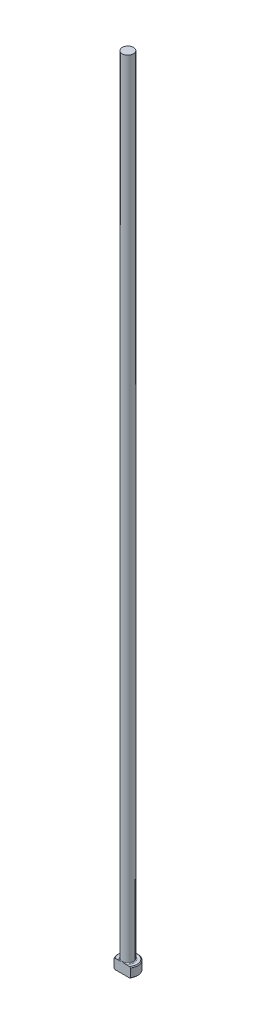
ISO-10303-21;
HEADER;
FILE_DESCRIPTION(('STEP AP214'),'2;1');
FILE_NAME('part.step','',(''),(''),'','','');
FILE_SCHEMA(('AUTOMOTIVE_DESIGN { 1 0 10303 214 1 1 1 1 }'));
ENDSEC;
DATA;
#1=APPLICATION_CONTEXT('core data for automotive mechanical design processes');
#2=APPLICATION_PROTOCOL_DEFINITION('international standard','automotive_design',2000,#1);
#3=PRODUCT_CONTEXT('',#1,'mechanical');
#4=PRODUCT('Part','Part','',(#3));
#5=PRODUCT_RELATED_PRODUCT_CATEGORY('part','',(#4));
#6=PRODUCT_DEFINITION_FORMATION('','',#4);
#7=PRODUCT_DEFINITION_CONTEXT('part definition',#1,'design');
#8=PRODUCT_DEFINITION('design','',#6,#7);
#9=PRODUCT_DEFINITION_SHAPE('','',#8);
#10=(LENGTH_UNIT() NAMED_UNIT(*) SI_UNIT(.MILLI.,.METRE.));
#11=(NAMED_UNIT(*) PLANE_ANGLE_UNIT() SI_UNIT($,.RADIAN.));
#12=(NAMED_UNIT(*) SI_UNIT($,.STERADIAN.) SOLID_ANGLE_UNIT());
#13=UNCERTAINTY_MEASURE_WITH_UNIT(LENGTH_MEASURE(1.E-05),#10,'distance_accuracy_value','');
#14=(GEOMETRIC_REPRESENTATION_CONTEXT(3) GLOBAL_UNCERTAINTY_ASSIGNED_CONTEXT((#13)) GLOBAL_UNIT_ASSIGNED_CONTEXT((#10,
#11,#12)) REPRESENTATION_CONTEXT('',''));
#15=CARTESIAN_POINT('',(0.,0.,0.));
#16=DIRECTION('',(0.,0.,1.));
#17=DIRECTION('',(1.,0.,0.));
#18=AXIS2_PLACEMENT_3D('',#15,#16,#17);
#19=CARTESIAN_POINT('',(0.,0.,0.));
#20=DIRECTION('',(0.,-1.,0.));
#21=DIRECTION('',(0.,0.,-1.));
#22=AXIS2_PLACEMENT_3D('',#19,#20,#21);
#23=PLANE('',#22);
#24=DIRECTION('',(1.,0.,0.));
#25=VECTOR('',#24,1.);
#26=CARTESIAN_POINT('',(-2.62529735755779,0.,1.78561999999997));
#27=LINE('',#26,#25);
#28=CARTESIAN_POINT('',(-2.31166654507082,0.,1.78561999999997));
#29=VERTEX_POINT('',#28);
#30=CARTESIAN_POINT('',(2.31166654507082,0.,1.78561999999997));
#31=VERTEX_POINT('',#30);
#32=EDGE_CURVE('E92',#29,#31,#27,.T.);
#33=ORIENTED_EDGE('',*,*,#32,.F.);
#34=CARTESIAN_POINT('',(0.,0.,0.));
#35=DIRECTION('',(0.,-1.,0.));
#36=DIRECTION('',(0.,0.,-1.));
#37=AXIS2_PLACEMENT_3D('',#34,#35,#36);
#38=CIRCLE('',#37,2.92099999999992);
#39=EDGE_CURVE('E105',#29,#31,#38,.T.);
#40=ORIENTED_EDGE('',*,*,#39,.T.);
#41=EDGE_LOOP('',(#33,#40));
#42=FACE_BOUND('',#41,.T.);
#43=ADVANCED_FACE('F37',(#42),#23,.T.);
#44=CARTESIAN_POINT('',(0.,259.958771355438,0.));
#45=DIRECTION('',(0.,1.,0.));
#46=DIRECTION('',(0.,0.,1.));
#47=AXIS2_PLACEMENT_3D('',#44,#45,#46);
#48=CYLINDRICAL_SURFACE('',#47,3.17499999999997);
#49=DIRECTION('',(0.,-1.,0.));
#50=VECTOR('',#49,1.);
#51=CARTESIAN_POINT('',(-2.62529735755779,254.,1.78561999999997));
#52=LINE('',#51,#50);
#53=CARTESIAN_POINT('',(-2.62529735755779,2.92100000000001,1.78561999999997));
#54=VERTEX_POINT('',#53);
#55=CARTESIAN_POINT('',(-2.62529735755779,0.254000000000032,1.78561999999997));
#56=VERTEX_POINT('',#55);
#57=EDGE_CURVE('E95',#54,#56,#52,.T.);
#58=ORIENTED_EDGE('',*,*,#57,.F.);
#59=CARTESIAN_POINT('',(0.,2.92100000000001,0.));
#60=DIRECTION('',(0.,1.,0.));
#61=DIRECTION('',(0.,0.,1.));
#62=AXIS2_PLACEMENT_3D('',#59,#60,#61);
#63=CIRCLE('',#62,3.17499999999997);
#64=CARTESIAN_POINT('',(2.62529735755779,2.92100000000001,1.78561999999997));
#65=VERTEX_POINT('',#64);
#66=EDGE_CURVE('E109',#54,#65,#63,.F.);
#67=ORIENTED_EDGE('',*,*,#66,.T.);
#68=DIRECTION('',(0.,-1.,0.));
#69=VECTOR('',#68,1.);
#70=CARTESIAN_POINT('',(2.62529735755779,254.,1.78561999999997));
#71=LINE('',#70,#69);
#72=CARTESIAN_POINT('',(2.62529735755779,0.254000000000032,1.78561999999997));
#73=VERTEX_POINT('',#72);
#74=EDGE_CURVE('E187',#65,#73,#71,.T.);
#75=ORIENTED_EDGE('',*,*,#74,.T.);
#76=CARTESIAN_POINT('',(0.,0.254000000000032,0.));
#77=DIRECTION('',(0.,-1.,0.));
#78=DIRECTION('',(0.,0.,-1.));
#79=AXIS2_PLACEMENT_3D('',#76,#77,#78);
#80=CIRCLE('',#79,3.17499999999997);
#81=EDGE_CURVE('E115',#73,#56,#80,.F.);
#82=ORIENTED_EDGE('',*,*,#81,.T.);
#83=EDGE_LOOP('',(#58,#67,#75,#82));
#84=FACE_BOUND('',#83,.T.);
#85=ADVANCED_FACE('F160',(#84),#48,.T.);
#86=CARTESIAN_POINT('',(-3.17499999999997,3.175,0.));
#87=DIRECTION('',(0.,1.,0.));
#88=DIRECTION('',(0.,0.,1.));
#89=AXIS2_PLACEMENT_3D('',#86,#87,#88);
#90=PLANE('',#89);
#91=DIRECTION('',(-1.,0.,0.));
#92=VECTOR('',#91,1.);
#93=CARTESIAN_POINT('',(-3.17499999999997,3.175,1.78561999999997));
#94=LINE('',#93,#92);
#95=CARTESIAN_POINT('',(2.31166654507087,3.175,1.78561999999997));
#96=VERTEX_POINT('',#95);
#97=CARTESIAN_POINT('',(0.98570328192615,3.175,1.78561999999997));
#98=VERTEX_POINT('',#97);
#99=EDGE_CURVE('E58',#96,#98,#94,.T.);
#100=ORIENTED_EDGE('',*,*,#99,.F.);
#101=CARTESIAN_POINT('',(0.,3.175,0.));
#102=DIRECTION('',(0.,1.,0.));
#103=DIRECTION('',(0.,0.,1.));
#104=AXIS2_PLACEMENT_3D('',#101,#102,#103);
#105=CIRCLE('',#104,2.92099999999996);
#106=CARTESIAN_POINT('',(-2.31166654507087,3.175,1.78561999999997));
#107=VERTEX_POINT('',#106);
#108=EDGE_CURVE('E182',#96,#107,#105,.T.);
#109=ORIENTED_EDGE('',*,*,#108,.T.);
#110=CARTESIAN_POINT('',(-0.985703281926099,3.17500000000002,1.78561999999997));
#111=VERTEX_POINT('',#110);
#112=EDGE_CURVE('E140',#111,#107,#94,.T.);
#113=ORIENTED_EDGE('',*,*,#112,.F.);
#114=CARTESIAN_POINT('',(0.,3.175,0.));
#115=DIRECTION('',(0.,1.,0.));
#116=DIRECTION('',(0.,0.,1.));
#117=AXIS2_PLACEMENT_3D('',#114,#115,#116);
#118=CIRCLE('',#117,2.03961999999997);
#119=EDGE_CURVE('E112',#111,#98,#118,.F.);
#120=ORIENTED_EDGE('',*,*,#119,.T.);
#121=EDGE_LOOP('',(#100,#109,#113,#120));
#122=FACE_BOUND('',#121,.T.);
#123=ADVANCED_FACE('F164',(#122),#90,.T.);
#124=CARTESIAN_POINT('',(0.,259.958771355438,0.));
#125=DIRECTION('',(0.,1.,0.));
#126=DIRECTION('',(0.,0.,1.));
#127=AXIS2_PLACEMENT_3D('',#124,#125,#126);
#128=CYLINDRICAL_SURFACE('',#127,1.78561999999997);
#129=CARTESIAN_POINT('',(0.,3.42900000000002,0.));
#130=DIRECTION('',(0.,1.,0.));
#131=DIRECTION('',(0.,0.,1.));
#132=AXIS2_PLACEMENT_3D('',#129,#130,#131);
#133=CIRCLE('',#132,1.78561999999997);
#134=CARTESIAN_POINT('',(0.,3.42900000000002,1.78561999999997));
#135=VERTEX_POINT('',#134);
#136=EDGE_CURVE('E108',#135,#135,#133,.T.);
#137=ORIENTED_EDGE('',*,*,#136,.T.);
#138=EDGE_LOOP('',(#137));
#139=FACE_BOUND('',#138,.T.);
#140=CARTESIAN_POINT('',(0.,254.,0.));
#141=DIRECTION('',(0.,1.,0.));
#142=DIRECTION('',(0.,0.,1.));
#143=AXIS2_PLACEMENT_3D('',#140,#141,#142);
#144=CIRCLE('',#143,1.78561999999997);
#145=CARTESIAN_POINT('',(0.,254.,1.78561999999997));
#146=VERTEX_POINT('',#145);
#147=EDGE_CURVE('E100',#146,#146,#144,.T.);
#148=ORIENTED_EDGE('',*,*,#147,.F.);
#149=EDGE_LOOP('',(#148));
#150=FACE_BOUND('',#149,.T.);
#151=ADVANCED_FACE('F169',(#139,#150),#128,.T.);
#152=CARTESIAN_POINT('',(-1.78561999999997,254.,0.));
#153=DIRECTION('',(0.,1.,0.));
#154=DIRECTION('',(0.,0.,1.));
#155=AXIS2_PLACEMENT_3D('',#152,#153,#154);
#156=PLANE('',#155);
#157=ORIENTED_EDGE('',*,*,#147,.T.);
#158=EDGE_LOOP('',(#157));
#159=FACE_BOUND('',#158,.T.);
#160=ADVANCED_FACE('F127',(#159),#156,.T.);
#161=CARTESIAN_POINT('',(0.,3.17499999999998,0.));
#162=DIRECTION('',(0.,-1.,0.));
#163=DIRECTION('',(0.,0.,-1.));
#164=AXIS2_PLACEMENT_3D('',#161,#162,#163);
#165=CONICAL_SURFACE('',#164,2.92099999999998,0.785398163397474);
#166=CARTESIAN_POINT('',(2.62599735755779,2.92042116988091,1.78561999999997));
#167=CARTESIAN_POINT('',(2.53391060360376,2.99651202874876,1.78561999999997));
#168=CARTESIAN_POINT('',(2.44124348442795,3.07192869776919,1.78561999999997));
#169=CARTESIAN_POINT('',(2.25420229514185,3.22083694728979,1.78561999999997));
#170=CARTESIAN_POINT('',(2.15982636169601,3.29432618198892,1.78561999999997));
#171=CARTESIAN_POINT('',(1.96686191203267,3.44026509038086,1.78561999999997));
#172=CARTESIAN_POINT('',(1.8682264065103,3.51265299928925,1.78561999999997));
#173=CARTESIAN_POINT('',(1.66817210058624,3.65342722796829,1.78561999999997));
#174=CARTESIAN_POINT('',(1.56675461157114,3.72181538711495,1.78561999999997));
#175=CARTESIAN_POINT('',(1.39486746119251,3.83076390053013,1.78561999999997));
#176=CARTESIAN_POINT('',(1.32543843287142,3.87295877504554,1.78561999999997));
#177=CARTESIAN_POINT('',(1.18462233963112,3.95393409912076,1.78561999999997));
#178=CARTESIAN_POINT('',(1.11323582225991,3.99271549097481,1.78561999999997));
#179=CARTESIAN_POINT('',(0.968528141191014,4.06558202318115,1.78561999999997));
#180=CARTESIAN_POINT('',(0.895218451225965,4.09968970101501,1.78561999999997));
#181=CARTESIAN_POINT('',(0.74610739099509,4.16195336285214,1.78561999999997));
#182=CARTESIAN_POINT('',(0.67030759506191,4.19011302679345,1.78561999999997));
#183=CARTESIAN_POINT('',(0.541388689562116,4.23076083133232,1.78561999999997));
#184=CARTESIAN_POINT('',(0.488938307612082,4.24536449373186,1.78561999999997));
#185=CARTESIAN_POINT('',(0.383072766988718,4.2704746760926,1.78561999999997));
#186=CARTESIAN_POINT('',(0.329658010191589,4.28098286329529,1.78561999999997));
#187=CARTESIAN_POINT('',(0.222265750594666,4.29737978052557,1.78561999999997));
#188=CARTESIAN_POINT('',(0.168290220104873,4.30328124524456,1.78561999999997));
#189=CARTESIAN_POINT('',(0.0600235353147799,4.31018800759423,1.78561999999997));
#190=CARTESIAN_POINT('',(0.00573239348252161,4.31119349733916,1.78561999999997));
#191=CARTESIAN_POINT('',(-0.102770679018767,4.30824837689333,1.78561999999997));
#192=CARTESIAN_POINT('',(-0.156982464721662,4.30429251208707,1.78561999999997));
#193=CARTESIAN_POINT('',(-0.264851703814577,4.2916403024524,1.78561999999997));
#194=CARTESIAN_POINT('',(-0.318509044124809,4.28294300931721,1.78561999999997));
#195=CARTESIAN_POINT('',(-0.425116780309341,4.26121729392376,1.78561999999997));
#196=CARTESIAN_POINT('',(-0.478064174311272,4.2481743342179,1.78561999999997));
#197=CARTESIAN_POINT('',(-0.58287202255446,4.21832694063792,1.78561999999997));
#198=CARTESIAN_POINT('',(-0.63473246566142,4.20152246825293,1.78561999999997));
#199=CARTESIAN_POINT('',(-0.806507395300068,4.13992967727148,1.78561999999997));
#200=CARTESIAN_POINT('',(-0.923850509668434,4.08797208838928,1.78561999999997));
#201=CARTESIAN_POINT('',(-1.15292848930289,3.97283365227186,1.78561999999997));
#202=CARTESIAN_POINT('',(-1.26465042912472,3.90962833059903,1.78561999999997));
#203=CARTESIAN_POINT('',(-1.4843973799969,3.7755968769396,1.78561999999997));
#204=CARTESIAN_POINT('',(-1.5923926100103,3.70472252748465,1.78561999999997));
#205=CARTESIAN_POINT('',(-1.80492556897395,3.55822828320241,1.78561999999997));
#206=CARTESIAN_POINT('',(-1.90946629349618,3.48261267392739,1.78561999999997));
#207=CARTESIAN_POINT('',(-2.11772685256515,3.3268192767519,1.78561999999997));
#208=CARTESIAN_POINT('',(-2.22140604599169,3.24658747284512,1.78561999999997));
#209=CARTESIAN_POINT('',(-2.37486531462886,3.12489307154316,1.78561999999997));
#210=CARTESIAN_POINT('',(-2.42538004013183,3.08434941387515,1.78561999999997));
#211=CARTESIAN_POINT('',(-2.52598890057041,3.00275013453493,1.78561999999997));
#212=CARTESIAN_POINT('',(-2.57608306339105,2.9616945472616,1.78561999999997));
#213=CARTESIAN_POINT('',(-2.62599735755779,2.92042116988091,1.78561999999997));
#214=B_SPLINE_CURVE_WITH_KNOTS('',3,(#166,#167,#168,#169,#170,#171,#172,#173,#174,#175,#176,
#177,#178,#179,#180,#181,#182,#183,#184,#185,#186,#187,#188,#189,#190,#191,#192,#193,#194,#195,
#196,#197,#198,#199,#200,#201,#202,#203,#204,#205,#206,#207,#208,#209,#210,#211,#212,#213),
.UNSPECIFIED.,.F.,.F.,(4,2,2,2,2,2,2,2,2,2,2,2,2,2,2,2,2,2,2,2,2,2,2,4),(0.,0.358392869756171,
0.717203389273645,1.08418335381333,1.45099320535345,1.69465880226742,1.93825692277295,
2.18063559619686,2.4228638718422,2.58606298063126,2.74919558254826,2.91187561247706,
3.07454925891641,3.23739534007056,3.40027400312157,3.5637031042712,3.72713387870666,
4.11103411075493,4.49578013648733,4.88310369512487,5.27008206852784,5.66332093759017,
5.85763723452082,6.0519405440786),.UNSPECIFIED.);
#215=EDGE_CURVE('E63',#65,#96,#214,.T.);
#216=ORIENTED_EDGE('',*,*,#215,.F.);
#217=ORIENTED_EDGE('',*,*,#66,.F.);
#218=EDGE_CURVE('E133',#107,#54,#214,.T.);
#219=ORIENTED_EDGE('',*,*,#218,.F.);
#220=ORIENTED_EDGE('',*,*,#108,.F.);
#221=EDGE_LOOP('',(#216,#217,#219,#220));
#222=FACE_BOUND('',#221,.T.);
#223=ADVANCED_FACE('F147',(#222),#165,.T.);
#224=CARTESIAN_POINT('',(0.,0.254000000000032,0.));
#225=DIRECTION('',(0.,1.,0.));
#226=DIRECTION('',(0.,0.,1.));
#227=AXIS2_PLACEMENT_3D('',#224,#225,#226);
#228=CONICAL_SURFACE('',#227,3.17499999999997,0.785398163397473);
#229=CARTESIAN_POINT('',(-2.62599735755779,0.254578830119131,1.78561999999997));
#230=CARTESIAN_POINT('',(-2.53391060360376,0.178487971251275,1.78561999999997));
#231=CARTESIAN_POINT('',(-2.44124348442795,0.103071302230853,1.78561999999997));
#232=CARTESIAN_POINT('',(-2.25420229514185,-0.0458369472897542,1.78561999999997));
#233=CARTESIAN_POINT('',(-2.15982636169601,-0.119326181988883,1.78561999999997));
#234=CARTESIAN_POINT('',(-1.96686191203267,-0.265265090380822,1.78561999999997));
#235=CARTESIAN_POINT('',(-1.8682264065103,-0.337652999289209,1.78561999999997));
#236=CARTESIAN_POINT('',(-1.66817210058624,-0.478427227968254,1.78561999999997));
#237=CARTESIAN_POINT('',(-1.56675461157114,-0.546815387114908,1.78561999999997));
#238=CARTESIAN_POINT('',(-1.39486746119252,-0.655763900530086,1.78561999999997));
#239=CARTESIAN_POINT('',(-1.32543843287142,-0.697958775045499,1.78561999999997));
#240=CARTESIAN_POINT('',(-1.18462233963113,-0.778934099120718,1.78561999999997));
#241=CARTESIAN_POINT('',(-1.11323582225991,-0.817715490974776,1.78561999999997));
#242=CARTESIAN_POINT('',(-0.968528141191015,-0.890582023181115,1.78561999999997));
#243=CARTESIAN_POINT('',(-0.895218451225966,-0.924689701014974,1.78561999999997));
#244=CARTESIAN_POINT('',(-0.746107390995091,-0.986953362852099,1.78561999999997));
#245=CARTESIAN_POINT('',(-0.670307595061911,-1.01511302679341,1.78561999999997));
#246=CARTESIAN_POINT('',(-0.541388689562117,-1.05576083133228,1.78561999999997));
#247=CARTESIAN_POINT('',(-0.488938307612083,-1.07036449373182,1.78561999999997));
#248=CARTESIAN_POINT('',(-0.383072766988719,-1.09547467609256,1.78561999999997));
#249=CARTESIAN_POINT('',(-0.32965801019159,-1.10598286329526,1.78561999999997));
#250=CARTESIAN_POINT('',(-0.222265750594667,-1.12237978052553,1.78561999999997));
#251=CARTESIAN_POINT('',(-0.168290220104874,-1.12828124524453,1.78561999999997));
#252=CARTESIAN_POINT('',(-0.0600235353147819,-1.1351880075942,1.78561999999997));
#253=CARTESIAN_POINT('',(-0.00573239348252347,-1.13619349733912,1.78561999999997));
#254=CARTESIAN_POINT('',(0.102770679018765,-1.13324837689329,1.78561999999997));
#255=CARTESIAN_POINT('',(0.15698246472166,-1.12929251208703,1.78561999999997));
#256=CARTESIAN_POINT('',(0.264851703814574,-1.11664030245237,1.78561999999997));
#257=CARTESIAN_POINT('',(0.318509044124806,-1.10794300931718,1.78561999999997));
#258=CARTESIAN_POINT('',(0.425116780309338,-1.08621729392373,1.78561999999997));
#259=CARTESIAN_POINT('',(0.47806417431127,-1.07317433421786,1.78561999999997));
#260=CARTESIAN_POINT('',(0.582872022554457,-1.04332694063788,1.78561999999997));
#261=CARTESIAN_POINT('',(0.634732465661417,-1.02652246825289,1.78561999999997));
#262=CARTESIAN_POINT('',(0.806507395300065,-0.964929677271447,1.78561999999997));
#263=CARTESIAN_POINT('',(0.92385050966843,-0.912972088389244,1.78561999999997));
#264=CARTESIAN_POINT('',(1.15292848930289,-0.797833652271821,1.78561999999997));
#265=CARTESIAN_POINT('',(1.26465042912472,-0.734628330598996,1.78561999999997));
#266=CARTESIAN_POINT('',(1.48439737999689,-0.60059687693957,1.78561999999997));
#267=CARTESIAN_POINT('',(1.59239261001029,-0.529722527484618,1.78561999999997));
#268=CARTESIAN_POINT('',(1.80492556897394,-0.383228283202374,1.78561999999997));
#269=CARTESIAN_POINT('',(1.90946629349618,-0.307612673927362,1.78561999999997));
#270=CARTESIAN_POINT('',(2.11772685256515,-0.151819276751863,1.78561999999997));
#271=CARTESIAN_POINT('',(2.22140604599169,-0.0715874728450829,1.78561999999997));
#272=CARTESIAN_POINT('',(2.37486531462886,0.0501069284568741,1.78561999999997));
#273=CARTESIAN_POINT('',(2.42538004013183,0.0906505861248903,1.78561999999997));
#274=CARTESIAN_POINT('',(2.52598890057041,0.172249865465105,1.78561999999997));
#275=CARTESIAN_POINT('',(2.57608306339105,0.213305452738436,1.78561999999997));
#276=CARTESIAN_POINT('',(2.62599735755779,0.254578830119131,1.78561999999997));
#277=B_SPLINE_CURVE_WITH_KNOTS('',3,(#229,#230,#231,#232,#233,#234,#235,#236,#237,#238,#239,
#240,#241,#242,#243,#244,#245,#246,#247,#248,#249,#250,#251,#252,#253,#254,#255,#256,#257,#258,
#259,#260,#261,#262,#263,#264,#265,#266,#267,#268,#269,#270,#271,#272,#273,#274,#275,#276),
.UNSPECIFIED.,.F.,.F.,(4,2,2,2,2,2,2,2,2,2,2,2,2,2,2,2,2,2,2,2,2,2,2,4),(0.,0.35839286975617,
0.717203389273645,1.08418335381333,1.45099320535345,1.69465880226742,1.93825692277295,
2.18063559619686,2.4228638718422,2.58606298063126,2.74919558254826,2.91187561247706,
3.07454925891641,3.23739534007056,3.40027400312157,3.56370310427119,3.72713387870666,
4.11103411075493,4.49578013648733,4.88310369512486,5.27008206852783,5.66332093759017,
5.85763723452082,6.05194054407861),.UNSPECIFIED.);
#278=EDGE_CURVE('E89',#56,#29,#277,.T.);
#279=ORIENTED_EDGE('',*,*,#278,.F.);
#280=ORIENTED_EDGE('',*,*,#81,.F.);
#281=EDGE_CURVE('E101',#31,#73,#277,.T.);
#282=ORIENTED_EDGE('',*,*,#281,.F.);
#283=ORIENTED_EDGE('',*,*,#39,.F.);
#284=EDGE_LOOP('',(#279,#280,#282,#283));
#285=FACE_BOUND('',#284,.T.);
#286=ADVANCED_FACE('F107',(#285),#228,.T.);
#287=CARTESIAN_POINT('',(0.,3.42900000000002,0.));
#288=DIRECTION('',(0.,1.,0.));
#289=DIRECTION('',(0.,0.,1.));
#290=AXIS2_PLACEMENT_3D('',#287,#288,#289);
#291=TOROIDAL_SURFACE('',#290,2.03961999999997,0.254);
#292=ORIENTED_EDGE('',*,*,#119,.F.);
#293=CARTESIAN_POINT('',(0.,3.42900000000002,1.78561999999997));
#294=CARTESIAN_POINT('',(-3.18449973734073E-11,3.42900057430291,1.78561999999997));
#295=CARTESIAN_POINT('',(-1.31743576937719E-07,3.42900114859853,1.78561999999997));
#296=CARTESIAN_POINT('',(-5.41978407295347E-07,3.42900224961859,1.78561999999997));
#297=CARTESIAN_POINT('',(-8.25231133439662E-07,3.42900277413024,1.78561999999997));
#298=CARTESIAN_POINT('',(-1.50411552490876E-06,3.42900382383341,1.78561999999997));
#299=CARTESIAN_POINT('',(-1.9084120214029E-06,3.42900434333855,1.78561999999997));
#300=CARTESIAN_POINT('',(-2.77577122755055E-06,3.42900531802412,1.78561999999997));
#301=CARTESIAN_POINT('',(-3.23817169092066E-06,3.42900577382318,1.78561999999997));
#302=CARTESIAN_POINT('',(-4.91210928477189E-06,3.42900732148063,1.78561999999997));
#303=CARTESIAN_POINT('',(-6.19920241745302E-06,3.42900833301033,1.78561999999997));
#304=CARTESIAN_POINT('',(-8.84399998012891E-06,3.42901011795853,1.78561999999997));
#305=CARTESIAN_POINT('',(-1.01964709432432E-05,3.42901089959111,1.78561999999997));
#306=CARTESIAN_POINT('',(-1.55351709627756E-05,3.42901388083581,1.78561999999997));
#307=CARTESIAN_POINT('',(-1.96089209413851E-05,3.42901593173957,1.78561999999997));
#308=CARTESIAN_POINT('',(-2.75952528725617E-05,3.42901924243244,1.78561999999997));
#309=CARTESIAN_POINT('',(-3.1484507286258E-05,3.42902056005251,1.78561999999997));
#310=CARTESIAN_POINT('',(-4.82184538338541E-05,3.42902623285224,1.78561999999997));
#311=CARTESIAN_POINT('',(-6.10523322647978E-05,3.42903059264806,1.78561999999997));
#312=CARTESIAN_POINT('',(-8.49728946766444E-05,3.42903751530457,1.78561999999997));
#313=CARTESIAN_POINT('',(-9.60061049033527E-05,3.42904025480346,1.78561999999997));
#314=CARTESIAN_POINT('',(-0.000176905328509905,3.42906215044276,1.78561999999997));
#315=CARTESIAN_POINT('',(-0.000243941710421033,3.42909033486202,1.78561999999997));
#316=CARTESIAN_POINT('',(-0.000505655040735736,3.42919637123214,1.78561999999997));
#317=CARTESIAN_POINT('',(-0.000702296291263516,3.42926750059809,1.78561999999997));
#318=CARTESIAN_POINT('',(-0.00146938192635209,3.42954905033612,1.78561999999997));
#319=CARTESIAN_POINT('',(-0.00203781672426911,3.42976651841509,1.78561999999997));
#320=CARTESIAN_POINT('',(-0.00437192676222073,3.43065529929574,1.78561999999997));
#321=CARTESIAN_POINT('',(-0.00613981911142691,3.43131864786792,1.78561999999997));
#322=CARTESIAN_POINT('',(-0.0297040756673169,3.44016568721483,1.78561999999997));
#323=CARTESIAN_POINT('',(-0.0514857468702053,3.44840344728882,1.78561999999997));
#324=CARTESIAN_POINT('',(-0.0942676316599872,3.46447621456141,1.78561999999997));
#325=CARTESIAN_POINT('',(-0.115266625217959,3.47231476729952,1.78561999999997));
#326=CARTESIAN_POINT('',(-0.159793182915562,3.4888081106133,1.78561999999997));
#327=CARTESIAN_POINT('',(-0.183325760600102,3.49744966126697,1.78561999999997));
#328=CARTESIAN_POINT('',(-0.230712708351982,3.51460090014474,1.78561999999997));
#329=CARTESIAN_POINT('',(-0.254567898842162,3.52310831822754,1.78561999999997));
#330=CARTESIAN_POINT('',(-0.313508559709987,3.5437088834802,1.78561999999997));
#331=CARTESIAN_POINT('',(-0.348655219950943,3.55562877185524,1.78561999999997));
#332=CARTESIAN_POINT('',(-0.418409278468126,3.5782679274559,1.78561999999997));
#333=CARTESIAN_POINT('',(-0.453009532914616,3.58900905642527,1.78561999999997));
#334=CARTESIAN_POINT('',(-0.527336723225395,3.61071513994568,1.78561999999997));
#335=CARTESIAN_POINT('',(-0.567114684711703,3.62150796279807,1.78561999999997));
#336=CARTESIAN_POINT('',(-0.647472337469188,3.64115045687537,1.78561999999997));
#337=CARTESIAN_POINT('',(-0.68805580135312,3.64998497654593,1.78561999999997));
#338=CARTESIAN_POINT('',(-0.772436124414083,3.66547366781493,1.78561999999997));
#339=CARTESIAN_POINT('',(-0.816267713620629,3.67194456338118,1.78561999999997));
#340=CARTESIAN_POINT('',(-0.904242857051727,3.68082976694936,1.78561999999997));
#341=CARTESIAN_POINT('',(-0.948384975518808,3.68325691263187,1.78561999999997));
#342=CARTESIAN_POINT('',(-1.0313695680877,3.68273347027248,1.78561999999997));
#343=CARTESIAN_POINT('',(-1.07021242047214,3.68039319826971,1.78561999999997));
#344=CARTESIAN_POINT('',(-1.14669891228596,3.67020391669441,1.78561999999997));
#345=CARTESIAN_POINT('',(-1.184351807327,3.66243997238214,1.78561999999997));
#346=CARTESIAN_POINT('',(-1.23851985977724,3.64542719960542,1.78561999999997));
#347=CARTESIAN_POINT('',(-1.2559215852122,3.63900919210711,1.78561999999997));
#348=CARTESIAN_POINT('',(-1.28988490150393,3.62409553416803,1.78561999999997));
#349=CARTESIAN_POINT('',(-1.3064446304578,3.61559550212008,1.78561999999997));
#350=CARTESIAN_POINT('',(-1.33562054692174,3.59770313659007,1.78561999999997));
#351=CARTESIAN_POINT('',(-1.34844802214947,3.58865946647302,1.78561999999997));
#352=CARTESIAN_POINT('',(-1.37250993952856,3.5686566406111,1.78561999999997));
#353=CARTESIAN_POINT('',(-1.38374844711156,3.55770253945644,1.78561999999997));
#354=CARTESIAN_POINT('',(-1.4007481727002,3.53749121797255,1.78561999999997));
#355=CARTESIAN_POINT('',(-1.40712841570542,3.52875692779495,1.78561999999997));
#356=CARTESIAN_POINT('',(-1.41843016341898,3.51038043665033,1.78561999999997));
#357=CARTESIAN_POINT('',(-1.42335244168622,3.50073872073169,1.78561999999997));
#358=CARTESIAN_POINT('',(-1.43142540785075,3.48061551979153,1.78561999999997));
#359=CARTESIAN_POINT('',(-1.43455811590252,3.47012668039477,1.78561999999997));
#360=CARTESIAN_POINT('',(-1.43867336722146,3.44873555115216,1.78561999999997));
#361=CARTESIAN_POINT('',(-1.4396581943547,3.43783371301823,1.78561999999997));
#362=CARTESIAN_POINT('',(-1.4394003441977,3.41762077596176,1.78561999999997));
#363=CARTESIAN_POINT('',(-1.43845541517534,3.40830462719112,1.78561999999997));
#364=CARTESIAN_POINT('',(-1.43499309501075,3.38997131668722,1.78561999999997));
#365=CARTESIAN_POINT('',(-1.43247548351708,3.38095419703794,1.78561999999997));
#366=CARTESIAN_POINT('',(-1.42607805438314,3.36352841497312,1.78561999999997));
#367=CARTESIAN_POINT('',(-1.42221225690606,3.35511452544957,1.78561999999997));
#368=CARTESIAN_POINT('',(-1.41333335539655,3.33892255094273,1.78561999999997));
#369=CARTESIAN_POINT('',(-1.40831987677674,3.33114467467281,1.78561999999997));
#370=CARTESIAN_POINT('',(-1.39430804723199,3.31214126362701,1.78561999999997));
#371=CARTESIAN_POINT('',(-1.38464463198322,3.30140546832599,1.78561999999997));
#372=CARTESIAN_POINT('',(-1.36373634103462,3.28159339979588,1.78561999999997));
#373=CARTESIAN_POINT('',(-1.35248673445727,3.27252228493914,1.78561999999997));
#374=CARTESIAN_POINT('',(-1.32243195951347,3.25135177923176,1.78561999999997));
#375=CARTESIAN_POINT('',(-1.30287278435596,3.24032875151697,1.78561999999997));
#376=CARTESIAN_POINT('',(-1.26238515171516,3.22138550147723,1.78561999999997));
#377=CARTESIAN_POINT('',(-1.24145706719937,3.21346443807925,1.78561999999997));
#378=CARTESIAN_POINT('',(-1.18308283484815,3.1952168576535,1.78561999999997));
#379=CARTESIAN_POINT('',(-1.14485059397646,3.18743307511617,1.78561999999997));
#380=CARTESIAN_POINT('',(-1.0672253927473,3.1773346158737,1.78561999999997));
#381=CARTESIAN_POINT('',(-1.02782362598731,3.1751030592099,1.78561999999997));
#382=CARTESIAN_POINT('',(-0.938308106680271,3.17487665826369,1.78561999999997));
#383=CARTESIAN_POINT('',(-0.888198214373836,3.17820052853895,1.78561999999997));
#384=CARTESIAN_POINT('',(-0.788427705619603,3.18979439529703,1.78561999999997));
#385=CARTESIAN_POINT('',(-0.738769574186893,3.19808345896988,1.78561999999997));
#386=CARTESIAN_POINT('',(-0.643546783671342,3.21758003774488,1.78561999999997));
#387=CARTESIAN_POINT('',(-0.59793238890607,3.22855229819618,1.78561999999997));
#388=CARTESIAN_POINT('',(-0.507711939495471,3.25269305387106,1.78561999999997));
#389=CARTESIAN_POINT('',(-0.463100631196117,3.26584230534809,1.78561999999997));
#390=CARTESIAN_POINT('',(-0.389189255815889,3.28909171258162,1.78561999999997));
#391=CARTESIAN_POINT('',(-0.359746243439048,3.29874562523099,1.78561999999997));
#392=CARTESIAN_POINT('',(-0.300309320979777,3.3188493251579,1.78561999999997));
#393=CARTESIAN_POINT('',(-0.270320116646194,3.32931300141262,1.78561999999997));
#394=CARTESIAN_POINT('',(-0.219891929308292,3.34729352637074,1.78561999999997));
#395=CARTESIAN_POINT('',(-0.199414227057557,3.35470273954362,1.78561999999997));
#396=CARTESIAN_POINT('',(-0.158717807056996,3.36958871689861,1.78561999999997));
#397=CARTESIAN_POINT('',(-0.138498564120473,3.37706404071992,1.78561999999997));
#398=CARTESIAN_POINT('',(-0.100226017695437,3.39130328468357,1.78561999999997));
#399=CARTESIAN_POINT('',(-0.0821695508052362,3.39805893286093,1.78561999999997));
#400=CARTESIAN_POINT('',(-0.0453815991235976,3.41189613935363,1.78561999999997));
#401=CARTESIAN_POINT('',(-0.0266509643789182,3.41898021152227,1.78561999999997));
#402=CARTESIAN_POINT('',(-0.00614045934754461,3.42668114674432,1.78561999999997));
#403=CARTESIAN_POINT('',(-0.0043731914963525,3.42734423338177,1.78561999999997));
#404=CARTESIAN_POINT('',(-0.00203923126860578,3.42823294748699,1.78561999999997));
#405=CARTESIAN_POINT('',(-0.00147031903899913,3.42845059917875,1.78561999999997));
#406=CARTESIAN_POINT('',(-0.000702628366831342,3.42873237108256,1.78561999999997));
#407=CARTESIAN_POINT('',(-0.000505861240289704,3.42880354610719,1.78561999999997));
#408=CARTESIAN_POINT('',(-0.000244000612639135,3.42890964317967,1.78561999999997));
#409=CARTESIAN_POINT('',(-0.000176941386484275,3.42893783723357,1.78561999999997));
#410=CARTESIAN_POINT('',(-9.60163381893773E-05,3.42895973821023,1.78561999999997));
#411=CARTESIAN_POINT('',(-8.49814748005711E-05,3.42896247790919,1.78561999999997));
#412=CARTESIAN_POINT('',(-6.10572445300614E-05,3.42896940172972,1.78561999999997));
#413=CARTESIAN_POINT('',(-4.82213958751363E-05,3.42897376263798,1.78561999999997));
#414=CARTESIAN_POINT('',(-3.14852412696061E-05,3.42897943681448,1.78561999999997));
#415=CARTESIAN_POINT('',(-2.75957358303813E-05,3.42898075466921,1.78561999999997));
#416=CARTESIAN_POINT('',(-1.96089257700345E-05,3.42898406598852,1.78561999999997));
#417=CARTESIAN_POINT('',(-1.55349584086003E-05,3.42898611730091,1.78561999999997));
#418=CARTESIAN_POINT('',(-1.01960510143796E-05,3.4289890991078,1.78561999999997));
#419=CARTESIAN_POINT('',(-8.8435605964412E-06,3.42898988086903,1.78561999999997));
#420=CARTESIAN_POINT('',(-6.198749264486E-06,3.42899166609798,1.78561999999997));
#421=CARTESIAN_POINT('',(-4.91166329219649E-06,3.42899267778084,1.78561999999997));
#422=CARTESIAN_POINT('',(-3.23776547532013E-06,3.42899422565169,1.78561999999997));
#423=CARTESIAN_POINT('',(-2.77538250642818E-06,3.42899468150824,1.78561999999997));
#424=CARTESIAN_POINT('',(-1.90806861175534E-06,3.42899565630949,1.78561999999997));
#425=CARTESIAN_POINT('',(-1.50380007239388E-06,3.42899617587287,1.78561999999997));
#426=CARTESIAN_POINT('',(-8.24983143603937E-07,3.42899722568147,1.78561999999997));
#427=CARTESIAN_POINT('',(-5.41768380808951E-07,3.42899775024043,1.78561999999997));
#428=CARTESIAN_POINT('',(-1.31626099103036E-07,3.42899885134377,1.78561999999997));
#429=CARTESIAN_POINT('',(3.18461949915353E-11,3.42899942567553,1.78561999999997));
#430=CARTESIAN_POINT('',(0.,3.42900000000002,1.78561999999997));
#431=B_SPLINE_CURVE_WITH_KNOTS('',3,(#293,#294,#295,#296,#297,#298,#299,#300,#301,#302,#303,
#304,#305,#306,#307,#308,#309,#310,#311,#312,#313,#314,#315,#316,#317,#318,#319,#320,#321,#322,
#323,#324,#325,#326,#327,#328,#329,#330,#331,#332,#333,#334,#335,#336,#337,#338,#339,#340,#341,
#342,#343,#344,#345,#346,#347,#348,#349,#350,#351,#352,#353,#354,#355,#356,#357,#358,#359,#360,
#361,#362,#363,#364,#365,#366,#367,#368,#369,#370,#371,#372,#373,#374,#375,#376,#377,#378,#379,
#380,#381,#382,#383,#384,#385,#386,#387,#388,#389,#390,#391,#392,#393,#394,#395,#396,#397,#398,
#399,#400,#401,#402,#403,#404,#405,#406,#407,#408,#409,#410,#411,#412,#413,#414,#415,#416,#417,
#418,#419,#420,#421,#422,#423,#424,#425,#426,#427,#428,#429,#430),.UNSPECIFIED.,.T.,.F.,(4,2,2,
2,2,2,2,2,2,2,2,2,2,2,2,2,2,2,2,2,2,2,2,2,2,2,2,2,2,2,2,2,2,2,2,2,2,2,2,2,2,2,2,2,2,2,2,2,2,2,2,
2,2,2,2,2,2,2,2,2,2,2,2,2,2,2,2,2,4),(0.,1.72270966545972E-06,3.50262163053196E-06,
5.46901782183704E-06,7.41474851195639E-06,1.23024977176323E-05,1.69850336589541E-05,
3.06278356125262E-05,4.29336919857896E-05,8.35899929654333E-05,0.000117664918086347,
0.000335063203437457,0.000963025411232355,0.00278807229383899,0.00845366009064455,
0.078308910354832,0.145553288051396,0.220759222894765,0.296738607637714,0.408067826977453,
0.516740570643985,0.640349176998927,0.764883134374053,0.897669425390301,1.03003335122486,
1.14651529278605,1.26121018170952,1.31675362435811,1.37241497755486,1.41935228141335,
1.46616723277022,1.49850384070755,1.5308232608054,1.563461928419,1.59606587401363,
1.62401827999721,1.65197460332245,1.679648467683,1.7073313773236,1.75041777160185,
1.79363550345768,1.8606099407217,1.92756620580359,2.0439635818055,2.16209328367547,
2.31238090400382,2.46324938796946,2.60391586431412,2.74339949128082,2.83635004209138,
2.93163203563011,2.99696231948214,3.06163208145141,3.1194700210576,3.17954069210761,
3.18520425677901,3.18703083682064,3.18765920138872,3.18787667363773,3.18791075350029,
3.18795141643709,3.18796372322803,3.1879773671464,3.18798204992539,3.18798693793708,
3.18798888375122,3.18799085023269,3.18799263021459,3.18799435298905),.UNSPECIFIED.);
#432=EDGE_CURVE('E11',#111,#135,#431,.T.);
#433=ORIENTED_EDGE('',*,*,#432,.T.);
#434=ORIENTED_EDGE('',*,*,#136,.F.);
#435=CARTESIAN_POINT('',(0.,3.42900000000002,1.78561999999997));
#436=CARTESIAN_POINT('',(3.18453179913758E-11,3.42899942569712,1.78561999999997));
#437=CARTESIAN_POINT('',(1.31743577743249E-07,3.4289988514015,1.78561999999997));
#438=CARTESIAN_POINT('',(5.41978408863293E-07,3.42899775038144,1.78561999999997));
#439=CARTESIAN_POINT('',(8.25231135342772E-07,3.42899722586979,1.78561999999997));
#440=CARTESIAN_POINT('',(1.50411552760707E-06,3.42899617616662,1.78561999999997));
#441=CARTESIAN_POINT('',(1.90841202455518E-06,3.42899565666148,1.78561999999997));
#442=CARTESIAN_POINT('',(2.77577123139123E-06,3.42899468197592,1.78561999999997));
#443=CARTESIAN_POINT('',(3.23817169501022E-06,3.42899422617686,1.78561999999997));
#444=CARTESIAN_POINT('',(4.91210928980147E-06,3.42899267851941,1.78561999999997));
#445=CARTESIAN_POINT('',(6.19920242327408E-06,3.42899166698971,1.78561999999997));
#446=CARTESIAN_POINT('',(8.84399998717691E-06,3.4289898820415,1.78561999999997));
#447=CARTESIAN_POINT('',(1.01964709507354E-05,3.42898910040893,1.78561999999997));
#448=CARTESIAN_POINT('',(1.55351709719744E-05,3.42898611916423,1.78561999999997));
#449=CARTESIAN_POINT('',(1.9608920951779E-05,3.42898406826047,1.78561999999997));
#450=CARTESIAN_POINT('',(2.75952528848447E-05,3.42898075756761,1.78561999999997));
#451=CARTESIAN_POINT('',(3.14845072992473E-05,3.42897943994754,1.78561999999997));
#452=CARTESIAN_POINT('',(4.82184538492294E-05,3.42897376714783,1.78561999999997));
#453=CARTESIAN_POINT('',(6.10523322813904E-05,3.42896940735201,1.78561999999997));
#454=CARTESIAN_POINT('',(8.49728946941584E-05,3.42896248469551,1.78561999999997));
#455=CARTESIAN_POINT('',(9.60061049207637E-05,3.42895974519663,1.78561999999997));
#456=CARTESIAN_POINT('',(0.00017690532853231,3.42893784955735,1.78561999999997));
#457=CARTESIAN_POINT('',(0.000243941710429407,3.42890966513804,1.78561999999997));
#458=CARTESIAN_POINT('',(0.000505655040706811,3.4288036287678,1.78561999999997));
#459=CARTESIAN_POINT('',(0.000702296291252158,3.4287324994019,1.78561999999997));
#460=CARTESIAN_POINT('',(0.00146938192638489,3.42845094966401,1.78561999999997));
#461=CARTESIAN_POINT('',(0.00203781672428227,3.42823348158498,1.78561999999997));
#462=CARTESIAN_POINT('',(0.0043719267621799,3.42734470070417,1.78561999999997));
#463=CARTESIAN_POINT('',(0.00613981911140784,3.42668135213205,1.78561999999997));
#464=CARTESIAN_POINT('',(0.0297040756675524,3.4178343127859,1.78561999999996));
#465=CARTESIAN_POINT('',(0.0514857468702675,3.40959655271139,1.78561999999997));
#466=CARTESIAN_POINT('',(0.0942676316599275,3.39352378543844,1.78561999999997));
#467=CARTESIAN_POINT('',(0.115266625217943,3.38568523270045,1.78561999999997));
#468=CARTESIAN_POINT('',(0.159793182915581,3.36919188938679,1.78561999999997));
#469=CARTESIAN_POINT('',(0.183325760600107,3.36055033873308,1.78561999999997));
#470=CARTESIAN_POINT('',(0.230712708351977,3.34339909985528,1.78561999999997));
#471=CARTESIAN_POINT('',(0.25456789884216,3.33489168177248,1.78561999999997));
#472=CARTESIAN_POINT('',(0.31350855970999,3.31429111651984,1.78561999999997));
#473=CARTESIAN_POINT('',(0.348655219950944,3.30237122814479,1.78561999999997));
#474=CARTESIAN_POINT('',(0.418409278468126,3.27973207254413,1.78561999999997));
#475=CARTESIAN_POINT('',(0.453009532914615,3.26899094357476,1.78561999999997));
#476=CARTESIAN_POINT('',(0.527336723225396,3.24728486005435,1.78561999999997));
#477=CARTESIAN_POINT('',(0.567114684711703,3.23649203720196,1.78561999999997));
#478=CARTESIAN_POINT('',(0.647472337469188,3.21684954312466,1.78561999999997));
#479=CARTESIAN_POINT('',(0.68805580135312,3.2080150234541,1.78561999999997));
#480=CARTESIAN_POINT('',(0.772436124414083,3.1925263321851,1.78561999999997));
#481=CARTESIAN_POINT('',(0.816267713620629,3.18605543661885,1.78561999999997));
#482=CARTESIAN_POINT('',(0.904242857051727,3.17717023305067,1.78561999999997));
#483=CARTESIAN_POINT('',(0.948384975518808,3.17474308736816,1.78561999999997));
#484=CARTESIAN_POINT('',(1.0313695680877,3.17526652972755,1.78561999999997));
#485=CARTESIAN_POINT('',(1.07021242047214,3.17760680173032,1.78561999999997));
#486=CARTESIAN_POINT('',(1.14669891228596,3.18779608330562,1.78561999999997));
#487=CARTESIAN_POINT('',(1.184351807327,3.19556002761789,1.78561999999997));
#488=CARTESIAN_POINT('',(1.23851985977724,3.21257280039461,1.78561999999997));
#489=CARTESIAN_POINT('',(1.2559215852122,3.21899080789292,1.78561999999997));
#490=CARTESIAN_POINT('',(1.28988490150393,3.233904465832,1.78561999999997));
#491=CARTESIAN_POINT('',(1.3064446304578,3.24240449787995,1.78561999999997));
#492=CARTESIAN_POINT('',(1.33562054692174,3.26029686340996,1.78561999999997));
#493=CARTESIAN_POINT('',(1.34844802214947,3.26934053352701,1.78561999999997));
#494=CARTESIAN_POINT('',(1.37250993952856,3.28934335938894,1.78561999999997));
#495=CARTESIAN_POINT('',(1.38374844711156,3.30029746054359,1.78561999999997));
#496=CARTESIAN_POINT('',(1.4007481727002,3.32050878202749,1.78561999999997));
#497=CARTESIAN_POINT('',(1.40712841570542,3.32924307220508,1.78561999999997));
#498=CARTESIAN_POINT('',(1.41843016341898,3.34761956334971,1.78561999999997));
#499=CARTESIAN_POINT('',(1.42335244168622,3.35726127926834,1.78561999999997));
#500=CARTESIAN_POINT('',(1.43142540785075,3.3773844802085,1.78561999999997));
#501=CARTESIAN_POINT('',(1.43455811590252,3.38787331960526,1.78561999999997));
#502=CARTESIAN_POINT('',(1.43867336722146,3.40926444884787,1.78561999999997));
#503=CARTESIAN_POINT('',(1.4396581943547,3.42016628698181,1.78561999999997));
#504=CARTESIAN_POINT('',(1.4394003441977,3.44037922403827,1.78561999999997));
#505=CARTESIAN_POINT('',(1.43845541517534,3.44969537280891,1.78561999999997));
#506=CARTESIAN_POINT('',(1.43499309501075,3.46802868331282,1.78561999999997));
#507=CARTESIAN_POINT('',(1.43247548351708,3.47704580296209,1.78561999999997));
#508=CARTESIAN_POINT('',(1.42607805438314,3.49447158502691,1.78561999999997));
#509=CARTESIAN_POINT('',(1.42221225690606,3.50288547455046,1.78561999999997));
#510=CARTESIAN_POINT('',(1.41333335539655,3.5190774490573,1.78561999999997));
#511=CARTESIAN_POINT('',(1.40831987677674,3.52685532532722,1.78561999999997));
#512=CARTESIAN_POINT('',(1.39430804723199,3.54585873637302,1.78561999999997));
#513=CARTESIAN_POINT('',(1.38464463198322,3.55659453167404,1.78561999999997));
#514=CARTESIAN_POINT('',(1.36373634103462,3.57640660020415,1.78561999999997));
#515=CARTESIAN_POINT('',(1.35248673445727,3.58547771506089,1.78561999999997));
#516=CARTESIAN_POINT('',(1.32243195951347,3.60664822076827,1.78561999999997));
#517=CARTESIAN_POINT('',(1.30287278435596,3.61767124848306,1.78561999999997));
#518=CARTESIAN_POINT('',(1.26238515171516,3.6366144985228,1.78561999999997));
#519=CARTESIAN_POINT('',(1.24145706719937,3.64453556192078,1.78561999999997));
#520=CARTESIAN_POINT('',(1.18308283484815,3.66278314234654,1.78561999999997));
#521=CARTESIAN_POINT('',(1.14485059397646,3.67056692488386,1.78561999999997));
#522=CARTESIAN_POINT('',(1.0672253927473,3.68066538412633,1.78561999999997));
#523=CARTESIAN_POINT('',(1.02782362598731,3.68289694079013,1.78561999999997));
#524=CARTESIAN_POINT('',(0.938308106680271,3.68312334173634,1.78561999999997));
#525=CARTESIAN_POINT('',(0.888198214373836,3.67979947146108,1.78561999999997));
#526=CARTESIAN_POINT('',(0.788427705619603,3.668205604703,1.78561999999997));
#527=CARTESIAN_POINT('',(0.738769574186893,3.65991654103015,1.78561999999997));
#528=CARTESIAN_POINT('',(0.643546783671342,3.64041996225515,1.78561999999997));
#529=CARTESIAN_POINT('',(0.59793238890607,3.62944770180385,1.78561999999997));
#530=CARTESIAN_POINT('',(0.507711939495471,3.60530694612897,1.78561999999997));
#531=CARTESIAN_POINT('',(0.463100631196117,3.59215769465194,1.78561999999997));
#532=CARTESIAN_POINT('',(0.389189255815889,3.56890828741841,1.78561999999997));
#533=CARTESIAN_POINT('',(0.359746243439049,3.55925437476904,1.78561999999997));
#534=CARTESIAN_POINT('',(0.300309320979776,3.53915067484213,1.78561999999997));
#535=CARTESIAN_POINT('',(0.270320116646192,3.52868699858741,1.78561999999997));
#536=CARTESIAN_POINT('',(0.219891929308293,3.51070647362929,1.78561999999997));
#537=CARTESIAN_POINT('',(0.199414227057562,3.50329726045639,1.78561999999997));
#538=CARTESIAN_POINT('',(0.158717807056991,3.48841128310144,1.78561999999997));
#539=CARTESIAN_POINT('',(0.138498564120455,3.48093595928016,1.78561999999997));
#540=CARTESIAN_POINT('',(0.100226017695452,3.46669671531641,1.78561999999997));
#541=CARTESIAN_POINT('',(0.0821695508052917,3.45994106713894,1.78561999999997));
#542=CARTESIAN_POINT('',(0.0453815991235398,3.44610386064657,1.78561999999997));
#543=CARTESIAN_POINT('',(0.0266509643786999,3.4390197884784,1.78561999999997));
#544=CARTESIAN_POINT('',(0.0061404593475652,3.43131885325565,1.78561999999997));
#545=CARTESIAN_POINT('',(0.00437319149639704,3.43065576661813,1.78561999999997));
#546=CARTESIAN_POINT('',(0.00203923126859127,3.42976705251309,1.78561999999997));
#547=CARTESIAN_POINT('',(0.001470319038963,3.42954940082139,1.78561999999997));
#548=CARTESIAN_POINT('',(0.00070262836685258,3.42926762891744,1.78561999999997));
#549=CARTESIAN_POINT('',(0.000505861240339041,3.42919645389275,1.78561999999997));
#550=CARTESIAN_POINT('',(0.000244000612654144,3.42909035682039,1.78561999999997));
#551=CARTESIAN_POINT('',(0.000176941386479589,3.42906216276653,1.78561999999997));
#552=CARTESIAN_POINT('',(9.60163381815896E-05,3.42904026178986,1.78561999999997));
#553=CARTESIAN_POINT('',(8.4981474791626E-05,3.42903752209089,1.78561999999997));
#554=CARTESIAN_POINT('',(6.10572445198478E-05,3.42903059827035,1.78561999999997));
#555=CARTESIAN_POINT('',(4.82213958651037E-05,3.42902623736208,1.78561999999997));
#556=CARTESIAN_POINT('',(3.14852412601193E-05,3.42902056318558,1.78561999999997));
#557=CARTESIAN_POINT('',(2.75957358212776E-05,3.42901924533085,1.78561999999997));
#558=CARTESIAN_POINT('',(1.96089257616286E-05,3.42901593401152,1.78561999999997));
#559=CARTESIAN_POINT('',(1.55349584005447E-05,3.42901388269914,1.78561999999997));
#560=CARTESIAN_POINT('',(1.0196051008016E-05,3.42901090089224,1.78561999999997));
#561=CARTESIAN_POINT('',(8.84356059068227E-06,3.429010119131,1.78561999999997));
#562=CARTESIAN_POINT('',(6.19874925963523E-06,3.42900833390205,1.78561999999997));
#563=CARTESIAN_POINT('',(4.91166328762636E-06,3.4290073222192,1.78561999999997));
#564=CARTESIAN_POINT('',(3.23776547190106E-06,3.42900577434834,1.78561999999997));
#565=CARTESIAN_POINT('',(2.77538250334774E-06,3.4290053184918,1.78561999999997));
#566=CARTESIAN_POINT('',(1.90806860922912E-06,3.42900434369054,1.78561999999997));
#567=CARTESIAN_POINT('',(1.50380007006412E-06,3.42900382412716,1.78561999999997));
#568=CARTESIAN_POINT('',(8.24983141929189E-07,3.42900277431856,1.78561999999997));
#569=CARTESIAN_POINT('',(5.41768379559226E-07,3.4290022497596,1.78561999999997));
#570=CARTESIAN_POINT('',(1.3162609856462E-07,3.42900114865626,1.78561999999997));
#571=CARTESIAN_POINT('',(-3.18465156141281E-11,3.4290005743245,1.78561999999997));
#572=CARTESIAN_POINT('',(0.,3.42900000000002,1.78561999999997));
#573=B_SPLINE_CURVE_WITH_KNOTS('',3,(#435,#436,#437,#438,#439,#440,#441,#442,#443,#444,#445,
#446,#447,#448,#449,#450,#451,#452,#453,#454,#455,#456,#457,#458,#459,#460,#461,#462,#463,#464,
#465,#466,#467,#468,#469,#470,#471,#472,#473,#474,#475,#476,#477,#478,#479,#480,#481,#482,#483,
#484,#485,#486,#487,#488,#489,#490,#491,#492,#493,#494,#495,#496,#497,#498,#499,#500,#501,#502,
#503,#504,#505,#506,#507,#508,#509,#510,#511,#512,#513,#514,#515,#516,#517,#518,#519,#520,#521,
#522,#523,#524,#525,#526,#527,#528,#529,#530,#531,#532,#533,#534,#535,#536,#537,#538,#539,#540,
#541,#542,#543,#544,#545,#546,#547,#548,#549,#550,#551,#552,#553,#554,#555,#556,#557,#558,#559,
#560,#561,#562,#563,#564,#565,#566,#567,#568,#569,#570,#571,#572),.UNSPECIFIED.,.T.,.F.,(4,2,2,
2,2,2,2,2,2,2,2,2,2,2,2,2,2,2,2,2,2,2,2,2,2,2,2,2,2,2,2,2,2,2,2,2,2,2,2,2,2,2,2,2,2,2,2,2,2,2,2,
2,2,2,2,2,2,2,2,2,2,2,2,2,2,2,2,2,4),(0.,1.72270966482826E-06,3.50262163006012E-06,
5.46901782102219E-06,7.41474851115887E-06,1.23024977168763E-05,1.69850336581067E-05,
3.06278356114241E-05,4.29336919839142E-05,8.35899929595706E-05,0.000117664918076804,
0.000335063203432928,0.000963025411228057,0.0027880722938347,0.00845366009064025,
0.0783089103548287,0.145553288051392,0.22075922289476,0.29673860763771,0.408067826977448,
0.51674057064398,0.640349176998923,0.764883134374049,0.897669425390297,1.03003335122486,
1.14651529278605,1.26121018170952,1.31675362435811,1.37241497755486,1.41935228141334,
1.46616723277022,1.49850384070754,1.5308232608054,1.563461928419,1.59606587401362,
1.62401827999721,1.65197460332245,1.67964846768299,1.7073313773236,1.75041777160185,
1.79363550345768,1.8606099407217,1.92756620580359,2.04396358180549,2.16209328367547,
2.31238090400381,2.46324938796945,2.60391586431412,2.74339949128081,2.83635004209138,
2.93163203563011,2.99696231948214,3.0616320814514,3.1194700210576,3.17954069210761,
3.185204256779,3.18703083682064,3.18765920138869,3.18787667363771,3.18791075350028,
3.18795141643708,3.18796372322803,3.1879773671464,3.18798204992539,3.18798693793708,
3.18798888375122,3.18799085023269,3.18799263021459,3.18799435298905),.UNSPECIFIED.);
#574=EDGE_CURVE('E51',#135,#98,#573,.T.);
#575=ORIENTED_EDGE('',*,*,#574,.T.);
#576=EDGE_LOOP('',(#292,#433,#434,#575));
#577=FACE_BOUND('',#576,.T.);
#578=ADVANCED_FACE('F39',(#577),#291,.F.);
#579=CARTESIAN_POINT('',(-2.62529735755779,254.,1.78561999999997));
#580=DIRECTION('',(0.,0.,-1.));
#581=DIRECTION('',(-1.,0.,0.));
#582=AXIS2_PLACEMENT_3D('',#579,#580,#581);
#583=PLANE('',#582);
#584=ORIENTED_EDGE('',*,*,#278,.T.);
#585=ORIENTED_EDGE('',*,*,#32,.T.);
#586=ORIENTED_EDGE('',*,*,#281,.T.);
#587=ORIENTED_EDGE('',*,*,#74,.F.);
#588=ORIENTED_EDGE('',*,*,#215,.T.);
#589=ORIENTED_EDGE('',*,*,#99,.T.);
#590=ORIENTED_EDGE('',*,*,#574,.F.);
#591=ORIENTED_EDGE('',*,*,#432,.F.);
#592=ORIENTED_EDGE('',*,*,#112,.T.);
#593=ORIENTED_EDGE('',*,*,#218,.T.);
#594=ORIENTED_EDGE('',*,*,#57,.T.);
#595=EDGE_LOOP('',(#584,#585,#586,#587,#588,#589,#590,#591,#592,#593,#594));
#596=FACE_BOUND('',#595,.T.);
#597=ADVANCED_FACE('F91',(#596),#583,.F.);
#598=CLOSED_SHELL('',(#43,#85,#123,#151,#160,#223,#286,#578,#597));
#599=MANIFOLD_SOLID_BREP('B2',#598);
#600=ADVANCED_BREP_SHAPE_REPRESENTATION('',(#18,#599),#14);
#601=SHAPE_DEFINITION_REPRESENTATION(#9,#600);
ENDSEC;
END-ISO-10303-21;
